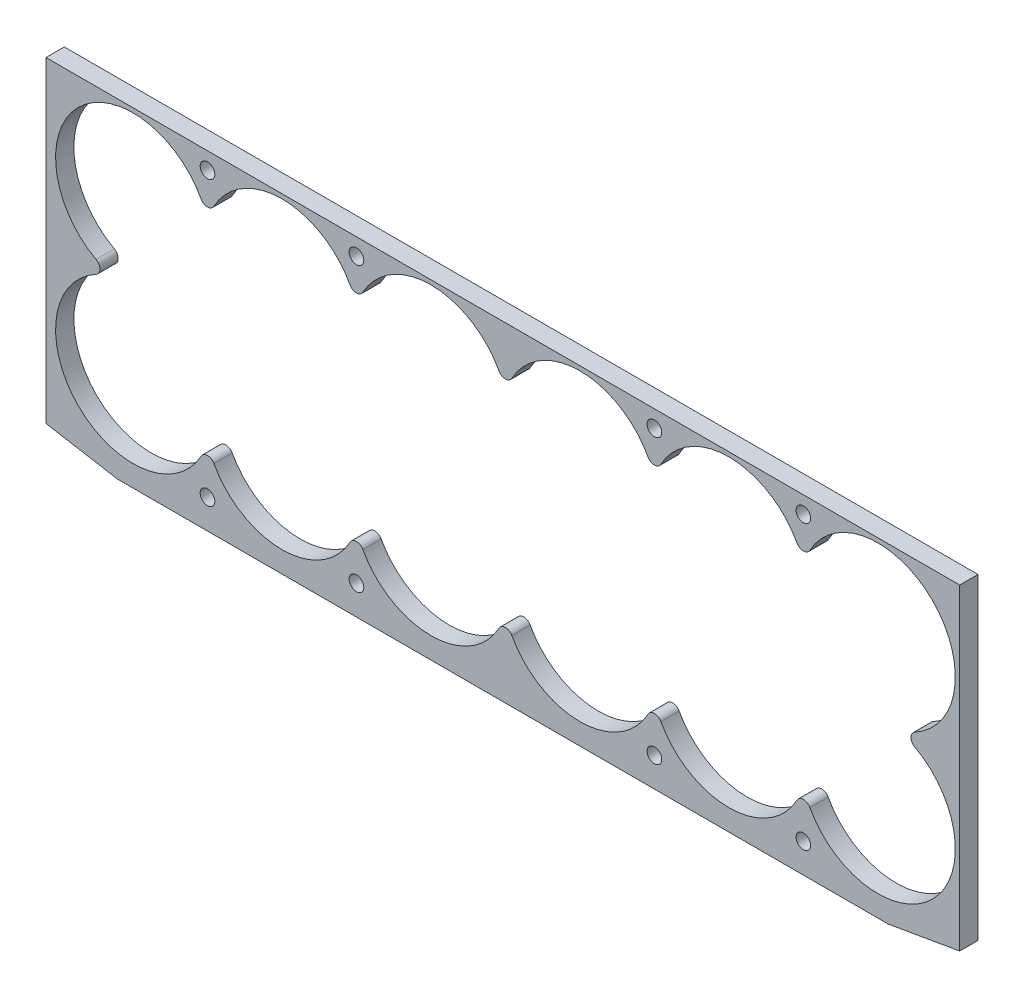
from build123d import *

# Parameters (mm, degrees)
SKETCH1_R           = 1.27
BOSS_EXTRUDE1_DEPTH = 3.175
FILLET1_R           = 1.27


with BuildPart() as part:
    # Sketch1 → Boss-Extrude1 (new body)
    with BuildSketch(Plane.XY):
        Polygon((1.27, 1.27), (1.27, -53.732604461), (-11.157711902, -55.88), (-144.842288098, -55.88), (-157.27, -53.732604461), (-157.27, 1.27), align=None)
        with Locations((-25.85, -50.8)):
            Circle(SKETCH1_R, mode=Mode.SUBTRACT)
        with Locations((-51.7, -50.8)):
            Circle(SKETCH1_R, mode=Mode.SUBTRACT)
        with Locations((-103.4, -50.8)):
            Circle(SKETCH1_R, mode=Mode.SUBTRACT)
        with Locations((-129.25, -50.8)):
            Circle(SKETCH1_R, mode=Mode.SUBTRACT)
        with Locations((-25.85, -1.662604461)):
            Circle(SKETCH1_R, mode=Mode.SUBTRACT)
        with Locations((-51.7, -1.662604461)):
            Circle(SKETCH1_R, mode=Mode.SUBTRACT)
        with Locations((-103.4, -1.662604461)):
            Circle(SKETCH1_R, mode=Mode.SUBTRACT)
        with Locations((-129.25, -1.662604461)):
            Circle(SKETCH1_R, mode=Mode.SUBTRACT)
        with BuildLine():
            ThreePointArc((-25.85, -42.43421631), (-3.426434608, -48.273565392), (-9.26578369, -25.85))
            ThreePointArc((-9.26578369, -25.85), (-3.426434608, -3.426434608), (-25.85, -9.26578369))
            ThreePointArc((-25.85, -9.26578369), (-38.775, 0.508), (-51.7, -9.26578369))
            ThreePointArc((-51.7, -9.26578369), (-64.625, 0.508), (-77.55, -9.26578369))
            ThreePointArc((-77.55, -9.26578369), (-90.475, 0.508), (-103.4, -9.26578369))
            ThreePointArc((-103.4, -9.26578369), (-116.325, 0.508), (-129.25, -9.26578369))
            ThreePointArc((-129.25, -9.26578369), (-151.673565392, -3.426434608), (-145.83421631, -25.85))
            ThreePointArc((-145.83421631, -25.85), (-151.673565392, -48.273565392), (-129.25, -42.43421631))
            ThreePointArc((-129.25, -42.43421631), (-116.325, -52.208), (-103.4, -42.43421631))
            ThreePointArc((-103.4, -42.43421631), (-90.475, -52.208), (-77.55, -42.43421631))
            ThreePointArc((-77.55, -42.43421631), (-64.625, -52.208), (-51.7, -42.43421631))
            ThreePointArc((-51.7, -42.43421631), (-38.775, -52.208), (-25.85, -42.43421631))
        make_face(mode=Mode.SUBTRACT)
    extrude(amount=BOSS_EXTRUDE1_DEPTH)

    # Fillet1
    fillet1_edges = [part.edges().sort_by_distance(p)[0] for p in [
        (-103.4, -9.26578369, 1.5875),
        (-129.25, -9.26578369, 1.5875),
        (-145.83421631, -25.85, 1.5875),
        (-129.25, -42.43421631, 1.5875),
        (-103.4, -42.43421631, 1.5875),
        (-77.55, -42.43421631, 1.5875),
        (-51.7, -42.43421631, 1.5875),
        (-25.85, -42.43421631, 1.5875),
        (-9.26578369, -25.85, 1.5875),
        (-25.85, -9.26578369, 1.5875),
        (-51.7, -9.26578369, 1.5875),
        (-77.55, -9.26578369, 1.5875),
    ]]
    fillet(fillet1_edges, radius=FILLET1_R)


solid = part.part
